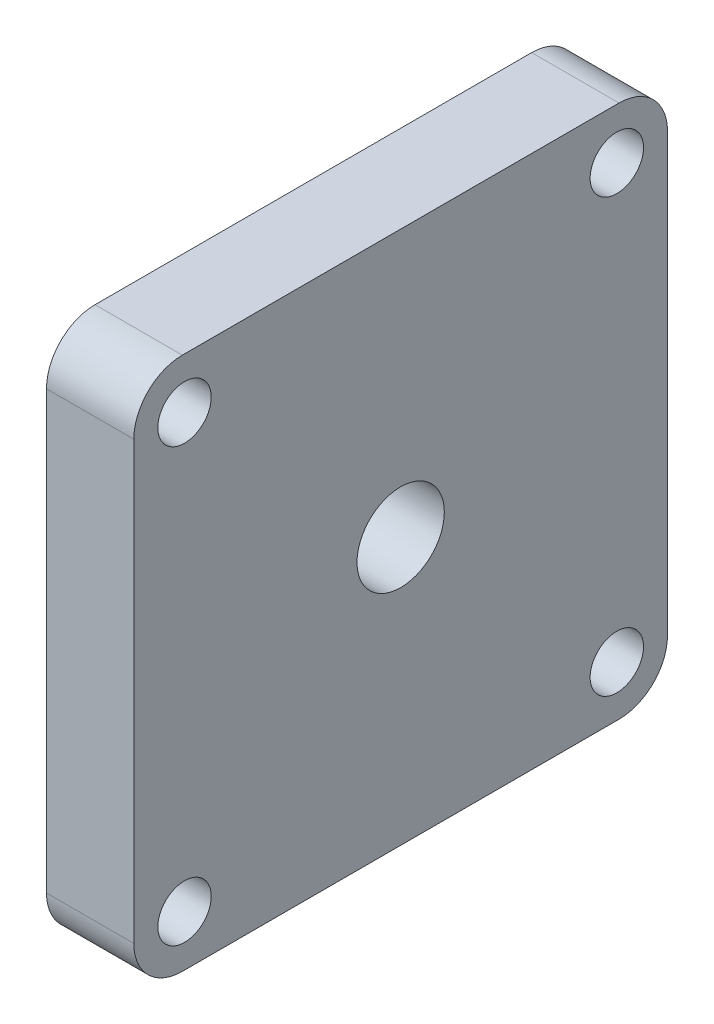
ISO-10303-21;
HEADER;
FILE_DESCRIPTION(('STEP AP214'),'2;1');
FILE_NAME('part.step','',(''),(''),'','','');
FILE_SCHEMA(('AUTOMOTIVE_DESIGN { 1 0 10303 214 1 1 1 1 }'));
ENDSEC;
DATA;
#1=APPLICATION_CONTEXT('core data for automotive mechanical design processes');
#2=APPLICATION_PROTOCOL_DEFINITION('international standard','automotive_design',2000,#1);
#3=PRODUCT_CONTEXT('',#1,'mechanical');
#4=PRODUCT('Part','Part','',(#3));
#5=PRODUCT_RELATED_PRODUCT_CATEGORY('part','',(#4));
#6=PRODUCT_DEFINITION_FORMATION('','',#4);
#7=PRODUCT_DEFINITION_CONTEXT('part definition',#1,'design');
#8=PRODUCT_DEFINITION('design','',#6,#7);
#9=PRODUCT_DEFINITION_SHAPE('','',#8);
#10=(LENGTH_UNIT() NAMED_UNIT(*) SI_UNIT(.MILLI.,.METRE.));
#11=(NAMED_UNIT(*) PLANE_ANGLE_UNIT() SI_UNIT($,.RADIAN.));
#12=(NAMED_UNIT(*) SI_UNIT($,.STERADIAN.) SOLID_ANGLE_UNIT());
#13=UNCERTAINTY_MEASURE_WITH_UNIT(LENGTH_MEASURE(1.E-05),#10,'distance_accuracy_value','');
#14=(GEOMETRIC_REPRESENTATION_CONTEXT(3) GLOBAL_UNCERTAINTY_ASSIGNED_CONTEXT((#13)) GLOBAL_UNIT_ASSIGNED_CONTEXT((#10,
#11,#12)) REPRESENTATION_CONTEXT('',''));
#15=CARTESIAN_POINT('',(0.,0.,0.));
#16=DIRECTION('',(0.,0.,1.));
#17=DIRECTION('',(1.,0.,0.));
#18=AXIS2_PLACEMENT_3D('',#15,#16,#17);
#19=CARTESIAN_POINT('',(8.99999999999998,-22.500000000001,22.5000000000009));
#20=DIRECTION('',(1.,0.,0.));
#21=DIRECTION('',(0.,0.,-1.));
#22=AXIS2_PLACEMENT_3D('',#19,#20,#21);
#23=PLANE('',#22);
#24=CARTESIAN_POINT('',(9.00000000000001,1.66533453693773E-13,0.));
#25=DIRECTION('',(1.,0.,0.));
#26=DIRECTION('',(0.,0.,-1.));
#27=AXIS2_PLACEMENT_3D('',#24,#25,#26);
#28=CIRCLE('',#27,4.5);
#29=CARTESIAN_POINT('',(9.00000000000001,1.66533453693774E-13,-4.49999999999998));
#30=VERTEX_POINT('',#29);
#31=EDGE_CURVE('E245',#30,#30,#28,.F.);
#32=ORIENTED_EDGE('',*,*,#31,.T.);
#33=EDGE_LOOP('',(#32));
#34=FACE_BOUND('',#33,.T.);
#35=CARTESIAN_POINT('',(9.00000000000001,-22.2738636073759,22.273863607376));
#36=DIRECTION('',(1.,0.,0.));
#37=DIRECTION('',(0.,0.,-1.));
#38=AXIS2_PLACEMENT_3D('',#35,#36,#37);
#39=CIRCLE('',#38,2.75);
#40=CARTESIAN_POINT('',(9.00000000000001,-22.2738636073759,19.523863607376));
#41=VERTEX_POINT('',#40);
#42=EDGE_CURVE('E267',#41,#41,#39,.T.);
#43=ORIENTED_EDGE('',*,*,#42,.F.);
#44=EDGE_LOOP('',(#43));
#45=FACE_BOUND('',#44,.T.);
#46=CARTESIAN_POINT('',(8.99999999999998,-22.273863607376,-22.273863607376));
#47=DIRECTION('',(1.,0.,0.));
#48=DIRECTION('',(0.,0.,-1.));
#49=AXIS2_PLACEMENT_3D('',#46,#47,#48);
#50=CIRCLE('',#49,2.75);
#51=CARTESIAN_POINT('',(8.99999999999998,-22.273863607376,-25.023863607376));
#52=VERTEX_POINT('',#51);
#53=EDGE_CURVE('E119',#52,#52,#50,.T.);
#54=ORIENTED_EDGE('',*,*,#53,.F.);
#55=EDGE_LOOP('',(#54));
#56=FACE_BOUND('',#55,.T.);
#57=CARTESIAN_POINT('',(8.99999999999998,-22.500000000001,22.5000000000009));
#58=DIRECTION('',(1.,0.,0.));
#59=DIRECTION('',(0.,0.,-1.));
#60=AXIS2_PLACEMENT_3D('',#57,#58,#59);
#61=CIRCLE('',#60,4.99999999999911);
#62=CARTESIAN_POINT('',(8.99999999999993,-22.5000000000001,27.5));
#63=VERTEX_POINT('',#62);
#64=CARTESIAN_POINT('',(9.00000000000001,-27.4999999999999,22.5));
#65=VERTEX_POINT('',#64);
#66=EDGE_CURVE('E137',#63,#65,#61,.T.);
#67=ORIENTED_EDGE('',*,*,#66,.T.);
#68=DIRECTION('',(0.,0.,-1.));
#69=VECTOR('',#68,1.);
#70=CARTESIAN_POINT('',(9.00000000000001,-27.4999999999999,22.5));
#71=LINE('',#70,#69);
#72=CARTESIAN_POINT('',(8.99999999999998,-27.5,-22.5));
#73=VERTEX_POINT('',#72);
#74=EDGE_CURVE('E112',#65,#73,#71,.T.);
#75=ORIENTED_EDGE('',*,*,#74,.T.);
#76=CARTESIAN_POINT('',(8.99999999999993,-22.5000000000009,-22.5000000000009));
#77=DIRECTION('',(1.,0.,0.));
#78=DIRECTION('',(0.,0.,-1.));
#79=AXIS2_PLACEMENT_3D('',#76,#77,#78);
#80=CIRCLE('',#79,4.99999999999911);
#81=CARTESIAN_POINT('',(8.99999999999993,-22.5,-27.5));
#82=VERTEX_POINT('',#81);
#83=EDGE_CURVE('E140',#73,#82,#80,.T.);
#84=ORIENTED_EDGE('',*,*,#83,.T.);
#85=DIRECTION('',(0.,1.,0.));
#86=VECTOR('',#85,1.);
#87=CARTESIAN_POINT('',(8.99999999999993,-22.5,-27.5));
#88=LINE('',#87,#86);
#89=CARTESIAN_POINT('',(8.99999999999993,22.5000000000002,-27.5));
#90=VERTEX_POINT('',#89);
#91=EDGE_CURVE('E142',#82,#90,#88,.T.);
#92=ORIENTED_EDGE('',*,*,#91,.T.);
#93=CARTESIAN_POINT('',(9.00000000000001,22.500000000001,-22.5000000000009));
#94=DIRECTION('',(1.,0.,0.));
#95=DIRECTION('',(0.,0.,-1.));
#96=AXIS2_PLACEMENT_3D('',#93,#94,#95);
#97=CIRCLE('',#96,4.99999999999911);
#98=CARTESIAN_POINT('',(8.99999999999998,27.5000000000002,-22.5));
#99=VERTEX_POINT('',#98);
#100=EDGE_CURVE('E144',#90,#99,#97,.T.);
#101=ORIENTED_EDGE('',*,*,#100,.T.);
#102=DIRECTION('',(0.,0.,1.));
#103=VECTOR('',#102,1.);
#104=CARTESIAN_POINT('',(8.99999999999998,27.5000000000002,-22.5));
#105=LINE('',#104,#103);
#106=CARTESIAN_POINT('',(9.00000000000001,27.5000000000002,22.5));
#107=VERTEX_POINT('',#106);
#108=EDGE_CURVE('E146',#99,#107,#105,.T.);
#109=ORIENTED_EDGE('',*,*,#108,.T.);
#110=CARTESIAN_POINT('',(9.00000000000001,22.500000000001,22.5000000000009));
#111=DIRECTION('',(1.,0.,0.));
#112=DIRECTION('',(0.,0.,-1.));
#113=AXIS2_PLACEMENT_3D('',#110,#111,#112);
#114=CIRCLE('',#113,4.99999999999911);
#115=CARTESIAN_POINT('',(8.99999999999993,22.5000000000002,27.5));
#116=VERTEX_POINT('',#115);
#117=EDGE_CURVE('E52',#107,#116,#114,.T.);
#118=ORIENTED_EDGE('',*,*,#117,.T.);
#119=DIRECTION('',(0.,-1.,0.));
#120=VECTOR('',#119,1.);
#121=CARTESIAN_POINT('',(8.99999999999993,22.5000000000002,27.5));
#122=LINE('',#121,#120);
#123=EDGE_CURVE('E47',#116,#63,#122,.T.);
#124=ORIENTED_EDGE('',*,*,#123,.T.);
#125=EDGE_LOOP('',(#67,#75,#84,#92,#101,#109,#118,#124));
#126=FACE_BOUND('',#125,.T.);
#127=CARTESIAN_POINT('',(8.99999999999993,22.2738636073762,-22.273863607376));
#128=DIRECTION('',(1.,0.,0.));
#129=DIRECTION('',(0.,0.,-1.));
#130=AXIS2_PLACEMENT_3D('',#127,#128,#129);
#131=CIRCLE('',#130,2.75);
#132=CARTESIAN_POINT('',(8.99999999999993,22.2738636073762,-25.023863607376));
#133=VERTEX_POINT('',#132);
#134=EDGE_CURVE('E273',#133,#133,#131,.T.);
#135=ORIENTED_EDGE('',*,*,#134,.F.);
#136=EDGE_LOOP('',(#135));
#137=FACE_BOUND('',#136,.T.);
#138=CARTESIAN_POINT('',(8.99999999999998,22.2738636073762,22.273863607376));
#139=DIRECTION('',(1.,0.,0.));
#140=DIRECTION('',(0.,0.,-1.));
#141=AXIS2_PLACEMENT_3D('',#138,#139,#140);
#142=CIRCLE('',#141,2.75);
#143=CARTESIAN_POINT('',(8.99999999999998,22.2738636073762,19.523863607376));
#144=VERTEX_POINT('',#143);
#145=EDGE_CURVE('E261',#144,#144,#142,.T.);
#146=ORIENTED_EDGE('',*,*,#145,.F.);
#147=EDGE_LOOP('',(#146));
#148=FACE_BOUND('',#147,.T.);
#149=ADVANCED_FACE('F31',(#34,#45,#56,#126,#137,#148),#23,.T.);
#150=CARTESIAN_POINT('',(0.,-22.5000000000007,22.5000000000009));
#151=DIRECTION('',(1.,0.,0.));
#152=DIRECTION('',(0.,0.,-1.));
#153=AXIS2_PLACEMENT_3D('',#150,#151,#152);
#154=PLANE('',#153);
#155=CARTESIAN_POINT('',(0.,0.,0.));
#156=DIRECTION('',(1.,0.,0.));
#157=DIRECTION('',(0.,0.,-1.));
#158=AXIS2_PLACEMENT_3D('',#155,#156,#157);
#159=CIRCLE('',#158,20.);
#160=CARTESIAN_POINT('',(0.,0.,-20.));
#161=VERTEX_POINT('',#160);
#162=EDGE_CURVE('E35',#161,#161,#159,.T.);
#163=ORIENTED_EDGE('',*,*,#162,.T.);
#164=EDGE_LOOP('',(#163));
#165=FACE_BOUND('',#164,.T.);
#166=CARTESIAN_POINT('',(0.,-22.2738636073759,22.273863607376));
#167=DIRECTION('',(1.,0.,0.));
#168=DIRECTION('',(0.,0.,-1.));
#169=AXIS2_PLACEMENT_3D('',#166,#167,#168);
#170=CIRCLE('',#169,2.75);
#171=CARTESIAN_POINT('',(0.,-22.2738636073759,19.523863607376));
#172=VERTEX_POINT('',#171);
#173=EDGE_CURVE('E264',#172,#172,#170,.T.);
#174=ORIENTED_EDGE('',*,*,#173,.T.);
#175=EDGE_LOOP('',(#174));
#176=FACE_BOUND('',#175,.T.);
#177=CARTESIAN_POINT('',(0.,-22.273863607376,-22.273863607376));
#178=DIRECTION('',(1.,0.,0.));
#179=DIRECTION('',(0.,0.,-1.));
#180=AXIS2_PLACEMENT_3D('',#177,#178,#179);
#181=CIRCLE('',#180,2.75);
#182=CARTESIAN_POINT('',(0.,-22.273863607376,-25.023863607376));
#183=VERTEX_POINT('',#182);
#184=EDGE_CURVE('E122',#183,#183,#181,.T.);
#185=ORIENTED_EDGE('',*,*,#184,.T.);
#186=EDGE_LOOP('',(#185));
#187=FACE_BOUND('',#186,.T.);
#188=CARTESIAN_POINT('',(0.,-22.5000000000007,22.5000000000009));
#189=DIRECTION('',(1.,0.,0.));
#190=DIRECTION('',(0.,0.,-1.));
#191=AXIS2_PLACEMENT_3D('',#188,#189,#190);
#192=CIRCLE('',#191,4.99999999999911);
#193=CARTESIAN_POINT('',(0.,-22.4999999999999,27.5));
#194=VERTEX_POINT('',#193);
#195=CARTESIAN_POINT('',(0.,-27.5,22.5));
#196=VERTEX_POINT('',#195);
#197=EDGE_CURVE('E103',#194,#196,#192,.T.);
#198=ORIENTED_EDGE('',*,*,#197,.F.);
#199=DIRECTION('',(0.,-1.,0.));
#200=VECTOR('',#199,1.);
#201=CARTESIAN_POINT('',(0.,22.5000000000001,27.5));
#202=LINE('',#201,#200);
#203=CARTESIAN_POINT('',(0.,22.5000000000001,27.5));
#204=VERTEX_POINT('',#203);
#205=EDGE_CURVE('E135',#204,#194,#202,.T.);
#206=ORIENTED_EDGE('',*,*,#205,.F.);
#207=CARTESIAN_POINT('',(0.,22.500000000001,22.5000000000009));
#208=DIRECTION('',(1.,0.,0.));
#209=DIRECTION('',(0.,0.,-1.));
#210=AXIS2_PLACEMENT_3D('',#207,#208,#209);
#211=CIRCLE('',#210,4.99999999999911);
#212=CARTESIAN_POINT('',(0.,27.5000000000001,22.5));
#213=VERTEX_POINT('',#212);
#214=EDGE_CURVE('E133',#213,#204,#211,.T.);
#215=ORIENTED_EDGE('',*,*,#214,.F.);
#216=DIRECTION('',(0.,0.,1.));
#217=VECTOR('',#216,1.);
#218=CARTESIAN_POINT('',(0.,27.5000000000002,-22.5));
#219=LINE('',#218,#217);
#220=CARTESIAN_POINT('',(0.,27.5000000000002,-22.5));
#221=VERTEX_POINT('',#220);
#222=EDGE_CURVE('E131',#221,#213,#219,.T.);
#223=ORIENTED_EDGE('',*,*,#222,.F.);
#224=CARTESIAN_POINT('',(0.,22.500000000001,-22.5000000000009));
#225=DIRECTION('',(1.,0.,0.));
#226=DIRECTION('',(0.,0.,-1.));
#227=AXIS2_PLACEMENT_3D('',#224,#225,#226);
#228=CIRCLE('',#227,4.99999999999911);
#229=CARTESIAN_POINT('',(0.,22.5000000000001,-27.5));
#230=VERTEX_POINT('',#229);
#231=EDGE_CURVE('E129',#230,#221,#228,.T.);
#232=ORIENTED_EDGE('',*,*,#231,.F.);
#233=DIRECTION('',(0.,1.,0.));
#234=VECTOR('',#233,1.);
#235=CARTESIAN_POINT('',(0.,-22.4999999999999,-27.5));
#236=LINE('',#235,#234);
#237=CARTESIAN_POINT('',(0.,-22.4999999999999,-27.5));
#238=VERTEX_POINT('',#237);
#239=EDGE_CURVE('E127',#238,#230,#236,.T.);
#240=ORIENTED_EDGE('',*,*,#239,.F.);
#241=CARTESIAN_POINT('',(0.,-22.5000000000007,-22.5000000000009));
#242=DIRECTION('',(1.,0.,0.));
#243=DIRECTION('',(0.,0.,-1.));
#244=AXIS2_PLACEMENT_3D('',#241,#242,#243);
#245=CIRCLE('',#244,4.99999999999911);
#246=CARTESIAN_POINT('',(0.,-27.5,-22.5));
#247=VERTEX_POINT('',#246);
#248=EDGE_CURVE('E105',#247,#238,#245,.T.);
#249=ORIENTED_EDGE('',*,*,#248,.F.);
#250=DIRECTION('',(0.,0.,-1.));
#251=VECTOR('',#250,1.);
#252=CARTESIAN_POINT('',(0.,-27.5,22.5));
#253=LINE('',#252,#251);
#254=EDGE_CURVE('E97',#196,#247,#253,.T.);
#255=ORIENTED_EDGE('',*,*,#254,.F.);
#256=EDGE_LOOP('',(#198,#206,#215,#223,#232,#240,#249,#255));
#257=FACE_BOUND('',#256,.T.);
#258=CARTESIAN_POINT('',(0.,22.2738636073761,-22.273863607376));
#259=DIRECTION('',(1.,0.,0.));
#260=DIRECTION('',(0.,0.,-1.));
#261=AXIS2_PLACEMENT_3D('',#258,#259,#260);
#262=CIRCLE('',#261,2.75);
#263=CARTESIAN_POINT('',(0.,22.2738636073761,-25.023863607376));
#264=VERTEX_POINT('',#263);
#265=EDGE_CURVE('E270',#264,#264,#262,.T.);
#266=ORIENTED_EDGE('',*,*,#265,.T.);
#267=EDGE_LOOP('',(#266));
#268=FACE_BOUND('',#267,.T.);
#269=CARTESIAN_POINT('',(0.,22.2738636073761,22.273863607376));
#270=DIRECTION('',(1.,0.,0.));
#271=DIRECTION('',(0.,0.,-1.));
#272=AXIS2_PLACEMENT_3D('',#269,#270,#271);
#273=CIRCLE('',#272,2.75);
#274=CARTESIAN_POINT('',(0.,22.2738636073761,19.523863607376));
#275=VERTEX_POINT('',#274);
#276=EDGE_CURVE('E258',#275,#275,#273,.T.);
#277=ORIENTED_EDGE('',*,*,#276,.T.);
#278=EDGE_LOOP('',(#277));
#279=FACE_BOUND('',#278,.T.);
#280=ADVANCED_FACE('F99',(#165,#176,#187,#257,#268,#279),#154,.F.);
#281=CARTESIAN_POINT('',(8.99999999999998,-22.500000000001,22.5000000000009));
#282=DIRECTION('',(-1.,0.,0.));
#283=DIRECTION('',(0.,0.,1.));
#284=AXIS2_PLACEMENT_3D('',#281,#282,#283);
#285=CYLINDRICAL_SURFACE('',#284,4.99999999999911);
#286=ORIENTED_EDGE('',*,*,#197,.T.);
#287=DIRECTION('',(-1.,0.,0.));
#288=VECTOR('',#287,1.);
#289=CARTESIAN_POINT('',(9.00000000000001,-27.4999999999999,22.5));
#290=LINE('',#289,#288);
#291=EDGE_CURVE('E40',#65,#196,#290,.T.);
#292=ORIENTED_EDGE('',*,*,#291,.F.);
#293=ORIENTED_EDGE('',*,*,#66,.F.);
#294=DIRECTION('',(-1.,0.,0.));
#295=VECTOR('',#294,1.);
#296=CARTESIAN_POINT('',(8.99999999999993,-22.5000000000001,27.5));
#297=LINE('',#296,#295);
#298=EDGE_CURVE('E118',#63,#194,#297,.T.);
#299=ORIENTED_EDGE('',*,*,#298,.T.);
#300=EDGE_LOOP('',(#286,#292,#293,#299));
#301=FACE_BOUND('',#300,.T.);
#302=ADVANCED_FACE('F33',(#301),#285,.T.);
#303=CARTESIAN_POINT('',(9.00000000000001,-27.4999999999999,22.5));
#304=DIRECTION('',(0.,1.,0.));
#305=DIRECTION('',(0.,0.,1.));
#306=AXIS2_PLACEMENT_3D('',#303,#304,#305);
#307=PLANE('',#306);
#308=ORIENTED_EDGE('',*,*,#254,.T.);
#309=DIRECTION('',(-1.,0.,0.));
#310=VECTOR('',#309,1.);
#311=CARTESIAN_POINT('',(8.99999999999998,-27.5,-22.5));
#312=LINE('',#311,#310);
#313=EDGE_CURVE('E115',#73,#247,#312,.T.);
#314=ORIENTED_EDGE('',*,*,#313,.F.);
#315=ORIENTED_EDGE('',*,*,#74,.F.);
#316=ORIENTED_EDGE('',*,*,#291,.T.);
#317=EDGE_LOOP('',(#308,#314,#315,#316));
#318=FACE_BOUND('',#317,.T.);
#319=ADVANCED_FACE('F111',(#318),#307,.F.);
#320=CARTESIAN_POINT('',(8.99999999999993,-22.5000000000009,-22.5000000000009));
#321=DIRECTION('',(-1.,0.,0.));
#322=DIRECTION('',(0.,0.,1.));
#323=AXIS2_PLACEMENT_3D('',#320,#321,#322);
#324=CYLINDRICAL_SURFACE('',#323,4.99999999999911);
#325=ORIENTED_EDGE('',*,*,#248,.T.);
#326=DIRECTION('',(-1.,0.,0.));
#327=VECTOR('',#326,1.);
#328=CARTESIAN_POINT('',(8.99999999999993,-22.5,-27.5));
#329=LINE('',#328,#327);
#330=EDGE_CURVE('E163',#82,#238,#329,.T.);
#331=ORIENTED_EDGE('',*,*,#330,.F.);
#332=ORIENTED_EDGE('',*,*,#83,.F.);
#333=ORIENTED_EDGE('',*,*,#313,.T.);
#334=EDGE_LOOP('',(#325,#331,#332,#333));
#335=FACE_BOUND('',#334,.T.);
#336=ADVANCED_FACE('F168',(#335),#324,.T.);
#337=CARTESIAN_POINT('',(8.99999999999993,-22.5,-27.5));
#338=DIRECTION('',(0.,0.,1.));
#339=DIRECTION('',(1.,0.,0.));
#340=AXIS2_PLACEMENT_3D('',#337,#338,#339);
#341=PLANE('',#340);
#342=ORIENTED_EDGE('',*,*,#239,.T.);
#343=DIRECTION('',(-1.,0.,0.));
#344=VECTOR('',#343,1.);
#345=CARTESIAN_POINT('',(8.99999999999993,22.5000000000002,-27.5));
#346=LINE('',#345,#344);
#347=EDGE_CURVE('E160',#90,#230,#346,.T.);
#348=ORIENTED_EDGE('',*,*,#347,.F.);
#349=ORIENTED_EDGE('',*,*,#91,.F.);
#350=ORIENTED_EDGE('',*,*,#330,.T.);
#351=EDGE_LOOP('',(#342,#348,#349,#350));
#352=FACE_BOUND('',#351,.T.);
#353=ADVANCED_FACE('F176',(#352),#341,.F.);
#354=CARTESIAN_POINT('',(9.00000000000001,22.500000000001,-22.5000000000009));
#355=DIRECTION('',(-1.,0.,0.));
#356=DIRECTION('',(0.,0.,1.));
#357=AXIS2_PLACEMENT_3D('',#354,#355,#356);
#358=CYLINDRICAL_SURFACE('',#357,4.99999999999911);
#359=ORIENTED_EDGE('',*,*,#231,.T.);
#360=DIRECTION('',(-1.,0.,0.));
#361=VECTOR('',#360,1.);
#362=CARTESIAN_POINT('',(8.99999999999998,27.5000000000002,-22.5));
#363=LINE('',#362,#361);
#364=EDGE_CURVE('E157',#99,#221,#363,.T.);
#365=ORIENTED_EDGE('',*,*,#364,.F.);
#366=ORIENTED_EDGE('',*,*,#100,.F.);
#367=ORIENTED_EDGE('',*,*,#347,.T.);
#368=EDGE_LOOP('',(#359,#365,#366,#367));
#369=FACE_BOUND('',#368,.T.);
#370=ADVANCED_FACE('F179',(#369),#358,.T.);
#371=CARTESIAN_POINT('',(8.99999999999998,27.5000000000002,-22.5));
#372=DIRECTION('',(0.,-1.,0.));
#373=DIRECTION('',(0.,0.,-1.));
#374=AXIS2_PLACEMENT_3D('',#371,#372,#373);
#375=PLANE('',#374);
#376=ORIENTED_EDGE('',*,*,#222,.T.);
#377=DIRECTION('',(-1.,0.,0.));
#378=VECTOR('',#377,1.);
#379=CARTESIAN_POINT('',(9.00000000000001,27.5000000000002,22.5));
#380=LINE('',#379,#378);
#381=EDGE_CURVE('E154',#107,#213,#380,.T.);
#382=ORIENTED_EDGE('',*,*,#381,.F.);
#383=ORIENTED_EDGE('',*,*,#108,.F.);
#384=ORIENTED_EDGE('',*,*,#364,.T.);
#385=EDGE_LOOP('',(#376,#382,#383,#384));
#386=FACE_BOUND('',#385,.T.);
#387=ADVANCED_FACE('F184',(#386),#375,.F.);
#388=CARTESIAN_POINT('',(9.00000000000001,22.500000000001,22.5000000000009));
#389=DIRECTION('',(-1.,0.,0.));
#390=DIRECTION('',(0.,0.,1.));
#391=AXIS2_PLACEMENT_3D('',#388,#389,#390);
#392=CYLINDRICAL_SURFACE('',#391,4.99999999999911);
#393=ORIENTED_EDGE('',*,*,#214,.T.);
#394=DIRECTION('',(-1.,0.,0.));
#395=VECTOR('',#394,1.);
#396=CARTESIAN_POINT('',(8.99999999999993,22.5000000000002,27.5));
#397=LINE('',#396,#395);
#398=EDGE_CURVE('E151',#116,#204,#397,.T.);
#399=ORIENTED_EDGE('',*,*,#398,.F.);
#400=ORIENTED_EDGE('',*,*,#117,.F.);
#401=ORIENTED_EDGE('',*,*,#381,.T.);
#402=EDGE_LOOP('',(#393,#399,#400,#401));
#403=FACE_BOUND('',#402,.T.);
#404=ADVANCED_FACE('F187',(#403),#392,.T.);
#405=CARTESIAN_POINT('',(8.99999999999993,22.5000000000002,27.5));
#406=DIRECTION('',(0.,0.,-1.));
#407=DIRECTION('',(-1.,0.,0.));
#408=AXIS2_PLACEMENT_3D('',#405,#406,#407);
#409=PLANE('',#408);
#410=ORIENTED_EDGE('',*,*,#205,.T.);
#411=ORIENTED_EDGE('',*,*,#298,.F.);
#412=ORIENTED_EDGE('',*,*,#123,.F.);
#413=ORIENTED_EDGE('',*,*,#398,.T.);
#414=EDGE_LOOP('',(#410,#411,#412,#413));
#415=FACE_BOUND('',#414,.T.);
#416=ADVANCED_FACE('F189',(#415),#409,.F.);
#417=CARTESIAN_POINT('',(8.99999999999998,-22.273863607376,-22.273863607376));
#418=DIRECTION('',(-1.,0.,0.));
#419=DIRECTION('',(0.,0.,1.));
#420=AXIS2_PLACEMENT_3D('',#417,#418,#419);
#421=CYLINDRICAL_SURFACE('',#420,2.75);
#422=ORIENTED_EDGE('',*,*,#53,.T.);
#423=EDGE_LOOP('',(#422));
#424=FACE_BOUND('',#423,.T.);
#425=ORIENTED_EDGE('',*,*,#184,.F.);
#426=EDGE_LOOP('',(#425));
#427=FACE_BOUND('',#426,.T.);
#428=ADVANCED_FACE('F191',(#424,#427),#421,.F.);
#429=CARTESIAN_POINT('',(8.99999999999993,22.2738636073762,-22.273863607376));
#430=DIRECTION('',(-1.,0.,0.));
#431=DIRECTION('',(0.,0.,1.));
#432=AXIS2_PLACEMENT_3D('',#429,#430,#431);
#433=CYLINDRICAL_SURFACE('',#432,2.75);
#434=ORIENTED_EDGE('',*,*,#134,.T.);
#435=EDGE_LOOP('',(#434));
#436=FACE_BOUND('',#435,.T.);
#437=ORIENTED_EDGE('',*,*,#265,.F.);
#438=EDGE_LOOP('',(#437));
#439=FACE_BOUND('',#438,.T.);
#440=ADVANCED_FACE('F197',(#436,#439),#433,.F.);
#441=CARTESIAN_POINT('',(9.00000000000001,-22.2738636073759,22.273863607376));
#442=DIRECTION('',(-1.,0.,0.));
#443=DIRECTION('',(0.,0.,1.));
#444=AXIS2_PLACEMENT_3D('',#441,#442,#443);
#445=CYLINDRICAL_SURFACE('',#444,2.75);
#446=ORIENTED_EDGE('',*,*,#42,.T.);
#447=EDGE_LOOP('',(#446));
#448=FACE_BOUND('',#447,.T.);
#449=ORIENTED_EDGE('',*,*,#173,.F.);
#450=EDGE_LOOP('',(#449));
#451=FACE_BOUND('',#450,.T.);
#452=ADVANCED_FACE('F215',(#448,#451),#445,.F.);
#453=CARTESIAN_POINT('',(8.99999999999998,22.2738636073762,22.273863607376));
#454=DIRECTION('',(-1.,0.,0.));
#455=DIRECTION('',(0.,0.,1.));
#456=AXIS2_PLACEMENT_3D('',#453,#454,#455);
#457=CYLINDRICAL_SURFACE('',#456,2.75);
#458=ORIENTED_EDGE('',*,*,#145,.T.);
#459=EDGE_LOOP('',(#458));
#460=FACE_BOUND('',#459,.T.);
#461=ORIENTED_EDGE('',*,*,#276,.F.);
#462=EDGE_LOOP('',(#461));
#463=FACE_BOUND('',#462,.T.);
#464=ADVANCED_FACE('F219',(#460,#463),#457,.F.);
#465=CARTESIAN_POINT('',(-2.,0.,0.));
#466=DIRECTION('',(1.,0.,0.));
#467=DIRECTION('',(0.,0.,-1.));
#468=AXIS2_PLACEMENT_3D('',#465,#466,#467);
#469=CYLINDRICAL_SURFACE('',#468,20.);
#470=CARTESIAN_POINT('',(-2.,0.,0.));
#471=DIRECTION('',(1.,0.,0.));
#472=DIRECTION('',(0.,0.,-1.));
#473=AXIS2_PLACEMENT_3D('',#470,#471,#472);
#474=CIRCLE('',#473,20.);
#475=CARTESIAN_POINT('',(-2.,0.,-20.));
#476=VERTEX_POINT('',#475);
#477=EDGE_CURVE('E252',#476,#476,#474,.T.);
#478=ORIENTED_EDGE('',*,*,#477,.T.);
#479=EDGE_LOOP('',(#478));
#480=FACE_BOUND('',#479,.T.);
#481=ORIENTED_EDGE('',*,*,#162,.F.);
#482=EDGE_LOOP('',(#481));
#483=FACE_BOUND('',#482,.T.);
#484=ADVANCED_FACE('F223',(#480,#483),#469,.T.);
#485=CARTESIAN_POINT('',(-2.,0.,0.));
#486=DIRECTION('',(1.,0.,0.));
#487=DIRECTION('',(0.,0.,-1.));
#488=AXIS2_PLACEMENT_3D('',#485,#486,#487);
#489=CYLINDRICAL_SURFACE('',#488,17.5);
#490=CARTESIAN_POINT('',(-2.,0.,0.));
#491=DIRECTION('',(1.,0.,0.));
#492=DIRECTION('',(0.,0.,-1.));
#493=AXIS2_PLACEMENT_3D('',#490,#491,#492);
#494=CIRCLE('',#493,17.5);
#495=CARTESIAN_POINT('',(-2.,0.,-17.5));
#496=VERTEX_POINT('',#495);
#497=EDGE_CURVE('E249',#496,#496,#494,.T.);
#498=ORIENTED_EDGE('',*,*,#497,.F.);
#499=EDGE_LOOP('',(#498));
#500=FACE_BOUND('',#499,.T.);
#501=CARTESIAN_POINT('',(0.,0.,0.));
#502=DIRECTION('',(1.,0.,0.));
#503=DIRECTION('',(0.,0.,-1.));
#504=AXIS2_PLACEMENT_3D('',#501,#502,#503);
#505=CIRCLE('',#504,17.5);
#506=CARTESIAN_POINT('',(0.,0.,-17.5));
#507=VERTEX_POINT('',#506);
#508=EDGE_CURVE('E11',#507,#507,#505,.T.);
#509=ORIENTED_EDGE('',*,*,#508,.T.);
#510=EDGE_LOOP('',(#509));
#511=FACE_BOUND('',#510,.T.);
#512=ADVANCED_FACE('F227',(#500,#511),#489,.F.);
#513=CARTESIAN_POINT('',(-2.,0.,0.));
#514=DIRECTION('',(1.,0.,0.));
#515=DIRECTION('',(0.,0.,-1.));
#516=AXIS2_PLACEMENT_3D('',#513,#514,#515);
#517=PLANE('',#516);
#518=ORIENTED_EDGE('',*,*,#497,.T.);
#519=EDGE_LOOP('',(#518));
#520=FACE_BOUND('',#519,.T.);
#521=ORIENTED_EDGE('',*,*,#477,.F.);
#522=EDGE_LOOP('',(#521));
#523=FACE_BOUND('',#522,.T.);
#524=ADVANCED_FACE('F229',(#520,#523),#517,.F.);
#525=CARTESIAN_POINT('',(0.,0.,0.));
#526=DIRECTION('',(-1.,0.,0.));
#527=DIRECTION('',(0.,0.,1.));
#528=AXIS2_PLACEMENT_3D('',#525,#526,#527);
#529=CIRCLE('',#528,4.5);
#530=CARTESIAN_POINT('',(0.,0.,4.5));
#531=VERTEX_POINT('',#530);
#532=EDGE_CURVE('E248',#531,#531,#529,.T.);
#533=ORIENTED_EDGE('',*,*,#532,.F.);
#534=EDGE_LOOP('',(#533));
#535=FACE_BOUND('',#534,.T.);
#536=ORIENTED_EDGE('',*,*,#508,.F.);
#537=EDGE_LOOP('',(#536));
#538=FACE_BOUND('',#537,.T.);
#539=ADVANCED_FACE('F209',(#535,#538),#154,.F.);
#540=CARTESIAN_POINT('',(9.00100000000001,1.66533453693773E-13,0.));
#541=DIRECTION('',(-1.,0.,0.));
#542=DIRECTION('',(0.,0.,1.));
#543=AXIS2_PLACEMENT_3D('',#540,#541,#542);
#544=CYLINDRICAL_SURFACE('',#543,4.5);
#545=ORIENTED_EDGE('',*,*,#31,.F.);
#546=EDGE_LOOP('',(#545));
#547=FACE_BOUND('',#546,.T.);
#548=ORIENTED_EDGE('',*,*,#532,.T.);
#549=EDGE_LOOP('',(#548));
#550=FACE_BOUND('',#549,.T.);
#551=ADVANCED_FACE('F236',(#547,#550),#544,.F.);
#552=CLOSED_SHELL('',(#149,#280,#302,#319,#336,#353,#370,#387,#404,#416,#428,#440,#452,#464,
#484,#512,#524,#539,#551));
#553=MANIFOLD_SOLID_BREP('B2',#552);
#554=ADVANCED_BREP_SHAPE_REPRESENTATION('',(#18,#553),#14);
#555=SHAPE_DEFINITION_REPRESENTATION(#9,#554);
ENDSEC;
END-ISO-10303-21;
